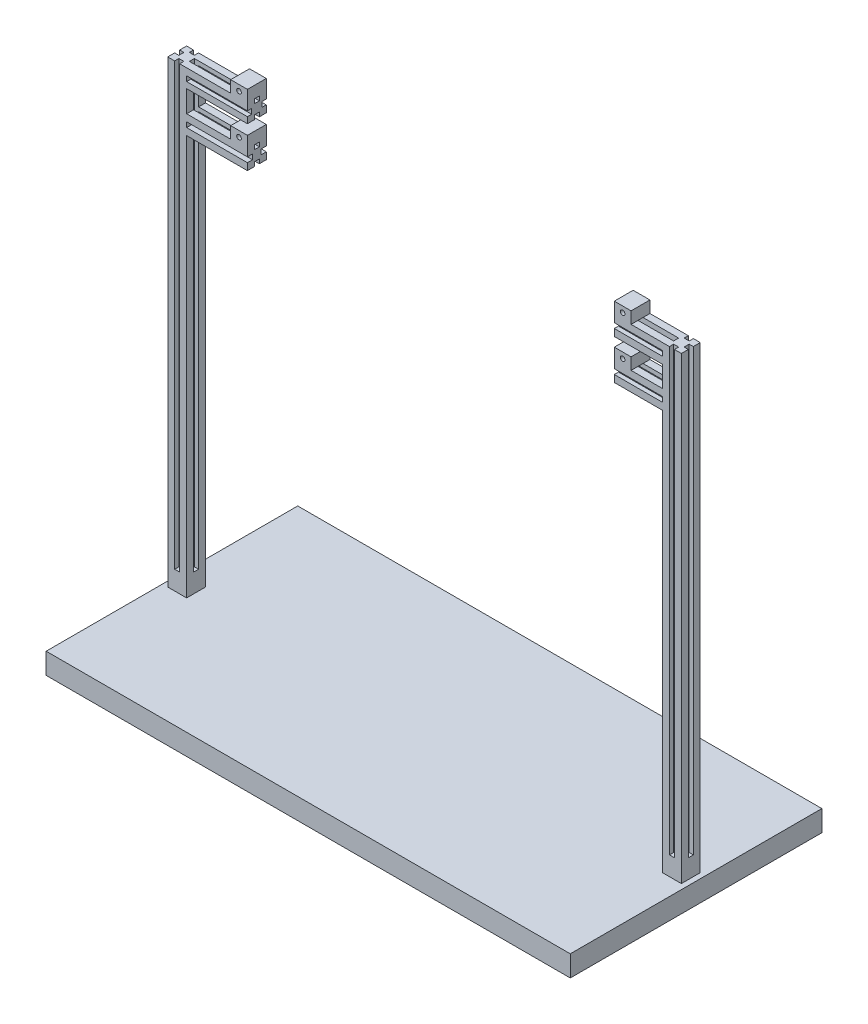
from build123d import *

# Parameters (mm, degrees)
SCHIZZO1_W                    = 1250
SCHIZZO1_H                    = 600
ESTRUSIONE_ESTRUSIONE1_DEPTH  = 50
SCHIZZO2_W                    = 45
SCHIZZO2_H                    = 45
ESTRUSIONE_ESTRUSIONE2_DEPTH  = 1095
SCHIZZO3_W                    = 45
SCHIZZO3_H                    = 45
ESTRUSIONE_ESTRUSIONE3_DEPTH  = 1095
SCHIZZO4_W                    = 12
SCHIZZO4_H                    = 10
SCHIZZO4_W_2                  = 10
SCHIZZO4_H_2                  = 12
TAGLIO_ESTRUSIONE1_DEPTH      = 1050
SCHIZZO5_W                    = 12
SCHIZZO5_H                    = 10
SCHIZZO5_W_2                  = 10
SCHIZZO5_H_2                  = 12
TAGLIO_ESTRUSIONE2_DEPTH      = 1050
SCHIZZO6_W                    = 12
SCHIZZO6_H                    = 12.5
ESTRUSIONE_ESTRUSIONE4_DEPTH  = 145
SCHIZZO9_W                    = 12
SCHIZZO9_H                    = 12.5
ESTRUSIONE_ESTRUSIONE6_DEPTH  = 115
SCHIZZO10_W                   = 40
SCHIZZO10_H                   = 45
ESTRUSIONE_ESTRUSIONE7_DEPTH  = 28
SCHIZZO11_R                   = 5.5
TAGLIO_ESTRUSIONE3_DEPTH      = 45
SCHIZZO12_W                   = 40
SCHIZZO12_H                   = 45
ESTRUSIONE_ESTRUSIONE8_DEPTH  = 28
SCHIZZO13_R                   = 5.5
TAGLIO_ESTRUSIONE4_DEPTH      = 45
ESTRUSIONE_ESTRUSIONE9_DEPTH  = 145
SCHIZZO15_W                   = 40
SCHIZZO15_H                   = 45
ESTRUSIONE_ESTRUSIONE10_DEPTH = 28
SCHIZZO16_R                   = 5.5
TAGLIO_ESTRUSIONE5_DEPTH      = 45
ESTRUSIONE_ESTRUSIONE11_DEPTH = 115
SCHIZZO18_W                   = 40
SCHIZZO18_H                   = 45
ESTRUSIONE_ESTRUSIONE12_DEPTH = 28
SCHIZZO19_R                   = 5.5
TAGLIO_ESTRUSIONE6_DEPTH      = 45


with BuildPart() as part:
    # Schizzo1 → Estrusione-Estrusione1 (new body)
    with BuildSketch(Plane(origin=(0, 0, 0), x_dir=(1, 0, 0), z_dir=(0, 1, 0))):
        Rectangle(SCHIZZO1_W, SCHIZZO1_H)
    extrude(amount=ESTRUSIONE_ESTRUSIONE1_DEPTH)

    # Schizzo2 → Estrusione-Estrusione2 (add)
    with BuildSketch(Plane(origin=(0, 50, 0), x_dir=(1, 0, 0), z_dir=(0, 1, 0))):
        with Locations((-590, 0)):
            Rectangle(SCHIZZO2_W, SCHIZZO2_H)
    extrude(amount=ESTRUSIONE_ESTRUSIONE2_DEPTH)

    # Schizzo3 → Estrusione-Estrusione3 (add)
    with BuildSketch(Plane(origin=(0, 50, 0), x_dir=(1, 0, 0), z_dir=(0, 1, 0))):
        with Locations((590, 0)):
            Rectangle(SCHIZZO3_W, SCHIZZO3_H)
    extrude(amount=ESTRUSIONE_ESTRUSIONE3_DEPTH)

    # Schizzo4 → Taglio-Estrusione1 (cut)
    with BuildSketch(Plane(origin=(0, 1145, 0), x_dir=(1, 0, 0), z_dir=(0, 1, 0))):
        with Locations((-590, 17.5)):
            Rectangle(SCHIZZO4_W, SCHIZZO4_H)
        with Locations((-607.5, 0)):
            Rectangle(SCHIZZO4_W_2, SCHIZZO4_H_2)
        with Locations((-590, -17.5)):
            Rectangle(SCHIZZO4_W, SCHIZZO4_H)
        with Locations((-572.5, 0)):
            Rectangle(SCHIZZO4_W_2, SCHIZZO4_H_2)
    extrude(amount=-TAGLIO_ESTRUSIONE1_DEPTH, mode=Mode.SUBTRACT)

    # Schizzo5 → Taglio-Estrusione2 (cut)
    with BuildSketch(Plane(origin=(0, 1145, 0), x_dir=(1, 0, 0), z_dir=(0, 1, 0))):
        with Locations((590, 17.5)):
            Rectangle(SCHIZZO5_W, SCHIZZO5_H)
        with Locations((572.5, 0)):
            Rectangle(SCHIZZO5_W_2, SCHIZZO5_H_2)
        with Locations((590, -17.5)):
            Rectangle(SCHIZZO5_W, SCHIZZO5_H)
        with Locations((607.5, 0)):
            Rectangle(SCHIZZO5_W_2, SCHIZZO5_H_2)
    extrude(amount=-TAGLIO_ESTRUSIONE2_DEPTH, mode=Mode.SUBTRACT)

    # Schizzo6 → Estrusione-Estrusione4 (add)
    with BuildSketch(Plane(origin=(-567.5, 0, 0), x_dir=(0, 0, -1), z_dir=(1, 0, 0))):
        Polygon((-6, 1015), (-6, 1027.5), (-10.5, 1027.5), (-10.5, 1021.5), (-22.5, 1021.5), (-22.5, 1005), (-6, 1005), align=None)
        with Locations((0, 1021.25)):
            Rectangle(SCHIZZO6_W, SCHIZZO6_H)
        Polygon((9.790683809, 1027.5), (6, 1027.5), (6, 1015), (6, 1005), (22.5, 1005), (22.5, 1021.5), (9.790683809, 1021.5), align=None)
        with Locations((0, 1033.75)):
            Rectangle(SCHIZZO6_W, SCHIZZO6_H)
        Polygon((-6, 1050), (-22.5, 1050), (-22.5, 1033.5), (-10.5, 1033.5), (-10.5, 1027.5), (-6, 1027.5), (-6, 1040), align=None)
        Polygon((22.5, 1050), (6, 1050), (6, 1040), (6, 1027.5), (9.790683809, 1027.5), (9.790683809, 1033.5), (22.5, 1033.5), align=None)
    extrude(amount=ESTRUSIONE_ESTRUSIONE4_DEPTH)

    # Schizzo9 → Estrusione-Estrusione6 (add)
    with BuildSketch(Plane.ZY.offset(-567.5)):
        with Locations((0, 1033.75)):
            Rectangle(SCHIZZO9_W, SCHIZZO9_H)
        with Locations((0, 1021.25)):
            Rectangle(SCHIZZO9_W, SCHIZZO9_H)
        Polygon((6, 1015), (6, 1005), (22.5, 1005), (22.5, 1021.5), (12.5, 1021.5), (12.5, 1027.5), (6, 1027.5), align=None)
        Polygon((-22.5, 1021.5), (-22.5, 1005), (-6, 1005), (-6, 1015), (-6, 1027.5), (-12.5, 1027.5), (-12.5, 1021.5), align=None)
        Polygon((-12.5, 1027.5), (-6, 1027.5), (-6, 1040), (-6, 1050), (-22.5, 1050), (-22.5, 1033.5), (-12.5, 1033.5), align=None)
        Polygon((6, 1040), (6, 1027.5), (12.5, 1027.5), (12.5, 1033.5), (22.5, 1033.5), (22.5, 1050), (6, 1050), align=None)
    extrude(amount=ESTRUSIONE_ESTRUSIONE6_DEPTH)

    # Schizzo10 → Estrusione-Estrusione7 (add)
    with BuildSketch(Plane(origin=(0, 1050, 0), x_dir=(1, 0, 0), z_dir=(0, 1, 0))):
        with Locations((-442.5, 0)):
            Rectangle(SCHIZZO10_W, SCHIZZO10_H)
    extrude(amount=ESTRUSIONE_ESTRUSIONE7_DEPTH)

    # Schizzo11 → Taglio-Estrusione3 (cut)
    with BuildSketch(Plane.XY.offset(22.5)):
        with Locations((-442.5, 1064)):
            Circle(SCHIZZO11_R)
    extrude(amount=-TAGLIO_ESTRUSIONE3_DEPTH, mode=Mode.SUBTRACT)

    # Schizzo12 → Estrusione-Estrusione8 (add)
    with BuildSketch(Plane(origin=(0, 1050, 0), x_dir=(1, 0, 0), z_dir=(0, 1, 0))):
        with Locations((472.5, 0)):
            Rectangle(SCHIZZO12_W, SCHIZZO12_H)
    extrude(amount=ESTRUSIONE_ESTRUSIONE8_DEPTH)

    # Schizzo13 → Taglio-Estrusione4 (cut)
    with BuildSketch(Plane.XY.offset(22.5)):
        with Locations((472.5, 1064)):
            Circle(SCHIZZO13_R)
    extrude(amount=-TAGLIO_ESTRUSIONE4_DEPTH, mode=Mode.SUBTRACT)

    # Schizzo14 → Estrusione-Estrusione9 (add)
    with BuildSketch(Plane(origin=(-567.5, 0, 0), x_dir=(0, 0, -1), z_dir=(1, 0, 0))):
        Polygon((22.5, 1145), (6, 1145), (6, 1135), (-6, 1135), (-6, 1111.924699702), (6, 1111.924699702), (6, 1101.924699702), (22.5, 1101.924699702), (22.5, 1118.424699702), (12.5, 1118.424699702), (12.5, 1130.424699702), (22.5, 1130.424699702), align=None)
        Polygon((-6, 1145), (-22.5, 1145), (-22.5, 1128.5), (-12.5, 1128.5), (-12.5, 1116.5), (-22.5, 1116.5), (-22.5, 1101.924699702), (-6, 1101.924699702), (-6, 1111.924699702), (-6, 1135), align=None)
    extrude(amount=ESTRUSIONE_ESTRUSIONE9_DEPTH)

    # Schizzo15 → Estrusione-Estrusione10 (add)
    with BuildSketch(Plane(origin=(0, 1145, 0), x_dir=(1, 0, 0), z_dir=(0, 1, 0))):
        with Locations((-442.5, 0)):
            Rectangle(SCHIZZO15_W, SCHIZZO15_H)
    extrude(amount=ESTRUSIONE_ESTRUSIONE10_DEPTH)

    # Schizzo16 → Taglio-Estrusione5 (cut)
    with BuildSketch(Plane.XY.offset(22.5)):
        with Locations((-442.5, 1159)):
            Circle(SCHIZZO16_R)
    extrude(amount=-TAGLIO_ESTRUSIONE5_DEPTH, mode=Mode.SUBTRACT)

    # Schizzo17 → Estrusione-Estrusione11 (add)
    with BuildSketch(Plane.ZY.offset(-567.5)):
        Polygon((-6, 1132.027010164), (-6, 1145), (-22.5, 1145), (-22.5, 1128.5), (-12.5, 1128.5), (-12.5, 1116.5), (-22.5, 1116.5), (-22.5, 1100), (-6, 1100), (-6, 1110), (6, 1110), (6, 1132.027010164), align=None)
        Polygon((22.5, 1128.5), (22.5, 1145), (6, 1145), (6, 1132.027010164), (6, 1110), (6, 1100), (22.5, 1100), (22.5, 1116.5), (12.5, 1116.5), (12.5, 1128.5), align=None)
    extrude(amount=ESTRUSIONE_ESTRUSIONE11_DEPTH)

    # Schizzo18 → Estrusione-Estrusione12 (add)
    with BuildSketch(Plane(origin=(0, 1145, 0), x_dir=(1, 0, 0), z_dir=(0, 1, 0))):
        with Locations((472.5, 0)):
            Rectangle(SCHIZZO18_W, SCHIZZO18_H)
    extrude(amount=ESTRUSIONE_ESTRUSIONE12_DEPTH)

    # Schizzo19 → Taglio-Estrusione6 (cut)
    with BuildSketch(Plane.XY.offset(22.5)):
        with Locations((472.5, 1159)):
            Circle(SCHIZZO19_R)
    extrude(amount=-TAGLIO_ESTRUSIONE6_DEPTH, mode=Mode.SUBTRACT)


solid = part.part
